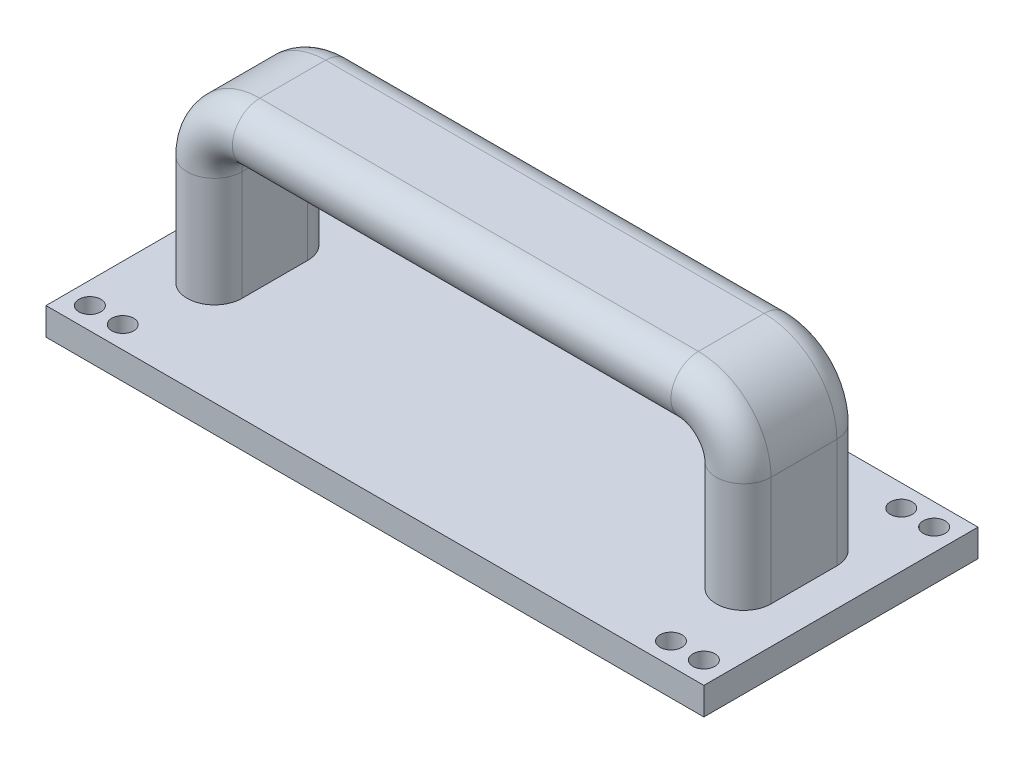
ISO-10303-21;
HEADER;
FILE_DESCRIPTION(('STEP AP214'),'2;1');
FILE_NAME('part.step','',(''),(''),'','','');
FILE_SCHEMA(('AUTOMOTIVE_DESIGN { 1 0 10303 214 1 1 1 1 }'));
ENDSEC;
DATA;
#1=APPLICATION_CONTEXT('core data for automotive mechanical design processes');
#2=APPLICATION_PROTOCOL_DEFINITION('international standard','automotive_design',2000,#1);
#3=PRODUCT_CONTEXT('',#1,'mechanical');
#4=PRODUCT('Part','Part','',(#3));
#5=PRODUCT_RELATED_PRODUCT_CATEGORY('part','',(#4));
#6=PRODUCT_DEFINITION_FORMATION('','',#4);
#7=PRODUCT_DEFINITION_CONTEXT('part definition',#1,'design');
#8=PRODUCT_DEFINITION('design','',#6,#7);
#9=PRODUCT_DEFINITION_SHAPE('','',#8);
#10=(LENGTH_UNIT() NAMED_UNIT(*) SI_UNIT(.MILLI.,.METRE.));
#11=(NAMED_UNIT(*) PLANE_ANGLE_UNIT() SI_UNIT($,.RADIAN.));
#12=(NAMED_UNIT(*) SI_UNIT($,.STERADIAN.) SOLID_ANGLE_UNIT());
#13=UNCERTAINTY_MEASURE_WITH_UNIT(LENGTH_MEASURE(1.E-05),#10,'distance_accuracy_value','');
#14=(GEOMETRIC_REPRESENTATION_CONTEXT(3) GLOBAL_UNCERTAINTY_ASSIGNED_CONTEXT((#13)) GLOBAL_UNIT_ASSIGNED_CONTEXT((#10,
#11,#12)) REPRESENTATION_CONTEXT('',''));
#15=CARTESIAN_POINT('',(0.,0.,0.));
#16=DIRECTION('',(0.,0.,1.));
#17=DIRECTION('',(1.,0.,0.));
#18=AXIS2_PLACEMENT_3D('',#15,#16,#17);
#19=CARTESIAN_POINT('',(0.,5.,0.));
#20=DIRECTION('',(0.,-1.,0.));
#21=DIRECTION('',(0.,0.,-1.));
#22=AXIS2_PLACEMENT_3D('',#19,#20,#21);
#23=PLANE('',#22);
#24=CARTESIAN_POINT('',(56.,5.,21.));
#25=DIRECTION('',(0.,1.,0.));
#26=DIRECTION('',(0.,0.,1.));
#27=AXIS2_PLACEMENT_3D('',#24,#25,#26);
#28=CIRCLE('',#27,2.);
#29=CARTESIAN_POINT('',(56.,5.,23.));
#30=VERTEX_POINT('',#29);
#31=EDGE_CURVE('E596',#30,#30,#28,.T.);
#32=ORIENTED_EDGE('',*,*,#31,.F.);
#33=EDGE_LOOP('',(#32));
#34=FACE_BOUND('',#33,.T.);
#35=CARTESIAN_POINT('',(-56.,5.,21.));
#36=DIRECTION('',(0.,1.,0.));
#37=DIRECTION('',(0.,0.,-1.));
#38=AXIS2_PLACEMENT_3D('',#35,#36,#37);
#39=CIRCLE('',#38,2.);
#40=CARTESIAN_POINT('',(-56.,5.,19.));
#41=VERTEX_POINT('',#40);
#42=EDGE_CURVE('E602',#41,#41,#39,.T.);
#43=ORIENTED_EDGE('',*,*,#42,.F.);
#44=EDGE_LOOP('',(#43));
#45=FACE_BOUND('',#44,.T.);
#46=CARTESIAN_POINT('',(-50.,5.,21.));
#47=DIRECTION('',(0.,1.,0.));
#48=DIRECTION('',(0.,0.,-1.));
#49=AXIS2_PLACEMENT_3D('',#46,#47,#48);
#50=CIRCLE('',#49,2.);
#51=CARTESIAN_POINT('',(-50.,5.,19.));
#52=VERTEX_POINT('',#51);
#53=EDGE_CURVE('E622',#52,#52,#50,.T.);
#54=ORIENTED_EDGE('',*,*,#53,.F.);
#55=EDGE_LOOP('',(#54));
#56=FACE_BOUND('',#55,.T.);
#57=CARTESIAN_POINT('',(-50.,5.,-21.));
#58=DIRECTION('',(0.,1.,0.));
#59=DIRECTION('',(0.,0.,1.));
#60=AXIS2_PLACEMENT_3D('',#57,#58,#59);
#61=CIRCLE('',#60,2.);
#62=CARTESIAN_POINT('',(-50.,5.,-19.));
#63=VERTEX_POINT('',#62);
#64=EDGE_CURVE('E614',#63,#63,#61,.T.);
#65=ORIENTED_EDGE('',*,*,#64,.F.);
#66=EDGE_LOOP('',(#65));
#67=FACE_BOUND('',#66,.T.);
#68=CARTESIAN_POINT('',(50.,5.,21.));
#69=DIRECTION('',(0.,1.,0.));
#70=DIRECTION('',(0.,0.,1.));
#71=AXIS2_PLACEMENT_3D('',#68,#69,#70);
#72=CIRCLE('',#71,2.);
#73=CARTESIAN_POINT('',(50.,5.,23.));
#74=VERTEX_POINT('',#73);
#75=EDGE_CURVE('E605',#74,#74,#72,.T.);
#76=ORIENTED_EDGE('',*,*,#75,.F.);
#77=EDGE_LOOP('',(#76));
#78=FACE_BOUND('',#77,.T.);
#79=CARTESIAN_POINT('',(50.,5.,-21.));
#80=DIRECTION('',(0.,1.,0.));
#81=DIRECTION('',(0.,0.,-1.));
#82=AXIS2_PLACEMENT_3D('',#79,#80,#81);
#83=CIRCLE('',#82,2.);
#84=CARTESIAN_POINT('',(50.,5.,-23.));
#85=VERTEX_POINT('',#84);
#86=EDGE_CURVE('E782',#85,#85,#83,.T.);
#87=ORIENTED_EDGE('',*,*,#86,.F.);
#88=EDGE_LOOP('',(#87));
#89=FACE_BOUND('',#88,.T.);
#90=CARTESIAN_POINT('',(56.,5.,-21.));
#91=DIRECTION('',(0.,1.,0.));
#92=DIRECTION('',(0.,0.,-1.));
#93=AXIS2_PLACEMENT_3D('',#90,#91,#92);
#94=CIRCLE('',#93,2.);
#95=CARTESIAN_POINT('',(56.,5.,-23.));
#96=VERTEX_POINT('',#95);
#97=EDGE_CURVE('E774',#96,#96,#94,.T.);
#98=ORIENTED_EDGE('',*,*,#97,.F.);
#99=EDGE_LOOP('',(#98));
#100=FACE_BOUND('',#99,.T.);
#101=CARTESIAN_POINT('',(-56.,5.,-21.));
#102=DIRECTION('',(0.,1.,0.));
#103=DIRECTION('',(0.,0.,1.));
#104=AXIS2_PLACEMENT_3D('',#101,#102,#103);
#105=CIRCLE('',#104,2.);
#106=CARTESIAN_POINT('',(-56.,5.,-19.));
#107=VERTEX_POINT('',#106);
#108=EDGE_CURVE('E613',#107,#107,#105,.T.);
#109=ORIENTED_EDGE('',*,*,#108,.F.);
#110=EDGE_LOOP('',(#109));
#111=FACE_BOUND('',#110,.T.);
#112=DIRECTION('',(0.,0.,-1.));
#113=VECTOR('',#112,1.);
#114=CARTESIAN_POINT('',(43.2576884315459,5.00000000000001,-6.));
#115=LINE('',#114,#113);
#116=CARTESIAN_POINT('',(43.2576884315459,5.00000000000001,6.));
#117=VERTEX_POINT('',#116);
#118=CARTESIAN_POINT('',(43.2576884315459,5.00000000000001,-6.));
#119=VERTEX_POINT('',#118);
#120=EDGE_CURVE('E151',#117,#119,#115,.T.);
#121=ORIENTED_EDGE('',*,*,#120,.T.);
#122=CARTESIAN_POINT('',(48.2576884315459,5.00000000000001,-6.));
#123=DIRECTION('',(0.,-1.,0.));
#124=DIRECTION('',(0.,0.,1.));
#125=AXIS2_PLACEMENT_3D('',#122,#123,#124);
#126=CIRCLE('',#125,5.);
#127=CARTESIAN_POINT('',(53.2576884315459,5.00000000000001,-6.));
#128=VERTEX_POINT('',#127);
#129=EDGE_CURVE('E159',#119,#128,#126,.T.);
#130=ORIENTED_EDGE('',*,*,#129,.T.);
#131=DIRECTION('',(0.,0.,1.));
#132=VECTOR('',#131,1.);
#133=CARTESIAN_POINT('',(53.2576884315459,5.00000000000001,-6.));
#134=LINE('',#133,#132);
#135=CARTESIAN_POINT('',(53.2576884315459,5.00000000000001,6.));
#136=VERTEX_POINT('',#135);
#137=EDGE_CURVE('E176',#128,#136,#134,.T.);
#138=ORIENTED_EDGE('',*,*,#137,.T.);
#139=CARTESIAN_POINT('',(48.2576884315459,5.00000000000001,6.));
#140=DIRECTION('',(0.,-1.,0.));
#141=DIRECTION('',(0.,0.,1.));
#142=AXIS2_PLACEMENT_3D('',#139,#140,#141);
#143=CIRCLE('',#142,5.);
#144=EDGE_CURVE('E166',#136,#117,#143,.T.);
#145=ORIENTED_EDGE('',*,*,#144,.T.);
#146=EDGE_LOOP('',(#121,#130,#138,#145));
#147=FACE_BOUND('',#146,.T.);
#148=DIRECTION('',(0.,0.,-1.));
#149=VECTOR('',#148,1.);
#150=CARTESIAN_POINT('',(60.,5.,25.));
#151=LINE('',#150,#149);
#152=CARTESIAN_POINT('',(60.,5.,25.));
#153=VERTEX_POINT('',#152);
#154=CARTESIAN_POINT('',(60.,5.,-25.));
#155=VERTEX_POINT('',#154);
#156=EDGE_CURVE('E212',#153,#155,#151,.T.);
#157=ORIENTED_EDGE('',*,*,#156,.T.);
#158=DIRECTION('',(-1.,0.,0.));
#159=VECTOR('',#158,1.);
#160=CARTESIAN_POINT('',(-60.,5.,-25.));
#161=LINE('',#160,#159);
#162=CARTESIAN_POINT('',(-60.,5.,-25.));
#163=VERTEX_POINT('',#162);
#164=EDGE_CURVE('E216',#155,#163,#161,.T.);
#165=ORIENTED_EDGE('',*,*,#164,.T.);
#166=DIRECTION('',(0.,0.,1.));
#167=VECTOR('',#166,1.);
#168=CARTESIAN_POINT('',(-60.,5.,25.));
#169=LINE('',#168,#167);
#170=CARTESIAN_POINT('',(-60.,5.,25.));
#171=VERTEX_POINT('',#170);
#172=EDGE_CURVE('E220',#163,#171,#169,.T.);
#173=ORIENTED_EDGE('',*,*,#172,.T.);
#174=DIRECTION('',(1.,0.,0.));
#175=VECTOR('',#174,1.);
#176=CARTESIAN_POINT('',(-60.,5.,25.));
#177=LINE('',#176,#175);
#178=EDGE_CURVE('E223',#171,#153,#177,.T.);
#179=ORIENTED_EDGE('',*,*,#178,.T.);
#180=EDGE_LOOP('',(#157,#165,#173,#179));
#181=FACE_BOUND('',#180,.T.);
#182=CARTESIAN_POINT('',(-48.2576884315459,5.,-6.));
#183=DIRECTION('',(0.,1.,0.));
#184=DIRECTION('',(0.,0.,1.));
#185=AXIS2_PLACEMENT_3D('',#182,#183,#184);
#186=CIRCLE('',#185,5.);
#187=CARTESIAN_POINT('',(-43.2576884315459,5.,-6.));
#188=VERTEX_POINT('',#187);
#189=CARTESIAN_POINT('',(-53.2576884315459,5.,-6.));
#190=VERTEX_POINT('',#189);
#191=EDGE_CURVE('E61',#188,#190,#186,.T.);
#192=ORIENTED_EDGE('',*,*,#191,.F.);
#193=DIRECTION('',(0.,0.,-1.));
#194=VECTOR('',#193,1.);
#195=CARTESIAN_POINT('',(-43.2576884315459,5.,-6.));
#196=LINE('',#195,#194);
#197=CARTESIAN_POINT('',(-43.2576884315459,5.,6.));
#198=VERTEX_POINT('',#197);
#199=EDGE_CURVE('E674',#198,#188,#196,.T.);
#200=ORIENTED_EDGE('',*,*,#199,.F.);
#201=CARTESIAN_POINT('',(-48.2576884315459,5.,6.));
#202=DIRECTION('',(0.,1.,0.));
#203=DIRECTION('',(0.,0.,1.));
#204=AXIS2_PLACEMENT_3D('',#201,#202,#203);
#205=CIRCLE('',#204,5.);
#206=CARTESIAN_POINT('',(-53.2576884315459,5.,6.));
#207=VERTEX_POINT('',#206);
#208=EDGE_CURVE('E207',#207,#198,#205,.T.);
#209=ORIENTED_EDGE('',*,*,#208,.F.);
#210=DIRECTION('',(0.,0.,1.));
#211=VECTOR('',#210,1.);
#212=CARTESIAN_POINT('',(-53.2576884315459,5.,-6.));
#213=LINE('',#212,#211);
#214=EDGE_CURVE('E723',#190,#207,#213,.T.);
#215=ORIENTED_EDGE('',*,*,#214,.F.);
#216=EDGE_LOOP('',(#192,#200,#209,#215));
#217=FACE_BOUND('',#216,.T.);
#218=ADVANCED_FACE('F37',(#34,#45,#56,#67,#78,#89,#100,#111,#147,#181,#217),#23,.F.);
#219=CARTESIAN_POINT('',(60.,5.,25.));
#220=DIRECTION('',(-1.,0.,0.));
#221=DIRECTION('',(0.,0.,1.));
#222=AXIS2_PLACEMENT_3D('',#219,#220,#221);
#223=PLANE('',#222);
#224=DIRECTION('',(0.,0.,-1.));
#225=VECTOR('',#224,1.);
#226=CARTESIAN_POINT('',(60.,0.,25.));
#227=LINE('',#226,#225);
#228=CARTESIAN_POINT('',(60.,0.,25.));
#229=VERTEX_POINT('',#228);
#230=CARTESIAN_POINT('',(60.,0.,-25.));
#231=VERTEX_POINT('',#230);
#232=EDGE_CURVE('E211',#229,#231,#227,.T.);
#233=ORIENTED_EDGE('',*,*,#232,.T.);
#234=DIRECTION('',(0.,-1.,0.));
#235=VECTOR('',#234,1.);
#236=CARTESIAN_POINT('',(60.,5.,-25.));
#237=LINE('',#236,#235);
#238=EDGE_CURVE('E11',#155,#231,#237,.T.);
#239=ORIENTED_EDGE('',*,*,#238,.F.);
#240=ORIENTED_EDGE('',*,*,#156,.F.);
#241=DIRECTION('',(0.,-1.,0.));
#242=VECTOR('',#241,1.);
#243=CARTESIAN_POINT('',(60.,5.,25.));
#244=LINE('',#243,#242);
#245=EDGE_CURVE('E226',#153,#229,#244,.T.);
#246=ORIENTED_EDGE('',*,*,#245,.T.);
#247=EDGE_LOOP('',(#233,#239,#240,#246));
#248=FACE_BOUND('',#247,.T.);
#249=ADVANCED_FACE('F39',(#248),#223,.F.);
#250=CARTESIAN_POINT('',(-60.,5.,-25.));
#251=DIRECTION('',(0.,0.,1.));
#252=DIRECTION('',(1.,0.,0.));
#253=AXIS2_PLACEMENT_3D('',#250,#251,#252);
#254=PLANE('',#253);
#255=DIRECTION('',(-1.,0.,0.));
#256=VECTOR('',#255,1.);
#257=CARTESIAN_POINT('',(-60.,0.,-25.));
#258=LINE('',#257,#256);
#259=CARTESIAN_POINT('',(-60.,0.,-25.));
#260=VERTEX_POINT('',#259);
#261=EDGE_CURVE('E230',#231,#260,#258,.T.);
#262=ORIENTED_EDGE('',*,*,#261,.T.);
#263=DIRECTION('',(0.,-1.,0.));
#264=VECTOR('',#263,1.);
#265=CARTESIAN_POINT('',(-60.,5.,-25.));
#266=LINE('',#265,#264);
#267=EDGE_CURVE('E46',#163,#260,#266,.T.);
#268=ORIENTED_EDGE('',*,*,#267,.F.);
#269=ORIENTED_EDGE('',*,*,#164,.F.);
#270=ORIENTED_EDGE('',*,*,#238,.T.);
#271=EDGE_LOOP('',(#262,#268,#269,#270));
#272=FACE_BOUND('',#271,.T.);
#273=ADVANCED_FACE('F264',(#272),#254,.F.);
#274=CARTESIAN_POINT('',(-60.,5.,25.));
#275=DIRECTION('',(1.,0.,0.));
#276=DIRECTION('',(0.,0.,-1.));
#277=AXIS2_PLACEMENT_3D('',#274,#275,#276);
#278=PLANE('',#277);
#279=DIRECTION('',(0.,0.,1.));
#280=VECTOR('',#279,1.);
#281=CARTESIAN_POINT('',(-60.,0.,25.));
#282=LINE('',#281,#280);
#283=CARTESIAN_POINT('',(-60.,0.,25.));
#284=VERTEX_POINT('',#283);
#285=EDGE_CURVE('E233',#260,#284,#282,.T.);
#286=ORIENTED_EDGE('',*,*,#285,.T.);
#287=DIRECTION('',(0.,-1.,0.));
#288=VECTOR('',#287,1.);
#289=CARTESIAN_POINT('',(-60.,5.,25.));
#290=LINE('',#289,#288);
#291=EDGE_CURVE('E241',#171,#284,#290,.T.);
#292=ORIENTED_EDGE('',*,*,#291,.F.);
#293=ORIENTED_EDGE('',*,*,#172,.F.);
#294=ORIENTED_EDGE('',*,*,#267,.T.);
#295=EDGE_LOOP('',(#286,#292,#293,#294));
#296=FACE_BOUND('',#295,.T.);
#297=ADVANCED_FACE('F250',(#296),#278,.F.);
#298=CARTESIAN_POINT('',(-60.,5.,25.));
#299=DIRECTION('',(0.,0.,-1.));
#300=DIRECTION('',(-1.,0.,0.));
#301=AXIS2_PLACEMENT_3D('',#298,#299,#300);
#302=PLANE('',#301);
#303=DIRECTION('',(1.,0.,0.));
#304=VECTOR('',#303,1.);
#305=CARTESIAN_POINT('',(-60.,0.,25.));
#306=LINE('',#305,#304);
#307=EDGE_CURVE('E217',#284,#229,#306,.T.);
#308=ORIENTED_EDGE('',*,*,#307,.T.);
#309=ORIENTED_EDGE('',*,*,#245,.F.);
#310=ORIENTED_EDGE('',*,*,#178,.F.);
#311=ORIENTED_EDGE('',*,*,#291,.T.);
#312=EDGE_LOOP('',(#308,#309,#310,#311));
#313=FACE_BOUND('',#312,.T.);
#314=ADVANCED_FACE('F259',(#313),#302,.F.);
#315=CARTESIAN_POINT('',(0.,0.,0.));
#316=DIRECTION('',(0.,-1.,0.));
#317=DIRECTION('',(0.,0.,-1.));
#318=AXIS2_PLACEMENT_3D('',#315,#316,#317);
#319=PLANE('',#318);
#320=CARTESIAN_POINT('',(56.,0.,21.));
#321=DIRECTION('',(0.,1.,0.));
#322=DIRECTION('',(0.,0.,1.));
#323=AXIS2_PLACEMENT_3D('',#320,#321,#322);
#324=CIRCLE('',#323,2.);
#325=CARTESIAN_POINT('',(56.,0.,23.));
#326=VERTEX_POINT('',#325);
#327=EDGE_CURVE('E594',#326,#326,#324,.T.);
#328=ORIENTED_EDGE('',*,*,#327,.T.);
#329=EDGE_LOOP('',(#328));
#330=FACE_BOUND('',#329,.T.);
#331=CARTESIAN_POINT('',(-56.,0.,21.));
#332=DIRECTION('',(0.,1.,0.));
#333=DIRECTION('',(0.,0.,-1.));
#334=AXIS2_PLACEMENT_3D('',#331,#332,#333);
#335=CIRCLE('',#334,2.);
#336=CARTESIAN_POINT('',(-56.,0.,19.));
#337=VERTEX_POINT('',#336);
#338=EDGE_CURVE('E626',#337,#337,#335,.T.);
#339=ORIENTED_EDGE('',*,*,#338,.T.);
#340=EDGE_LOOP('',(#339));
#341=FACE_BOUND('',#340,.T.);
#342=CARTESIAN_POINT('',(-50.,0.,21.));
#343=DIRECTION('',(0.,1.,0.));
#344=DIRECTION('',(0.,0.,-1.));
#345=AXIS2_PLACEMENT_3D('',#342,#343,#344);
#346=CIRCLE('',#345,2.);
#347=CARTESIAN_POINT('',(-50.,0.,19.));
#348=VERTEX_POINT('',#347);
#349=EDGE_CURVE('E618',#348,#348,#346,.T.);
#350=ORIENTED_EDGE('',*,*,#349,.T.);
#351=EDGE_LOOP('',(#350));
#352=FACE_BOUND('',#351,.T.);
#353=CARTESIAN_POINT('',(-50.,0.,-21.));
#354=DIRECTION('',(0.,1.,0.));
#355=DIRECTION('',(0.,0.,1.));
#356=AXIS2_PLACEMENT_3D('',#353,#354,#355);
#357=CIRCLE('',#356,2.);
#358=CARTESIAN_POINT('',(-50.,0.,-19.));
#359=VERTEX_POINT('',#358);
#360=EDGE_CURVE('E609',#359,#359,#357,.T.);
#361=ORIENTED_EDGE('',*,*,#360,.T.);
#362=EDGE_LOOP('',(#361));
#363=FACE_BOUND('',#362,.T.);
#364=CARTESIAN_POINT('',(50.,0.,21.));
#365=DIRECTION('',(0.,1.,0.));
#366=DIRECTION('',(0.,0.,1.));
#367=AXIS2_PLACEMENT_3D('',#364,#365,#366);
#368=CIRCLE('',#367,2.);
#369=CARTESIAN_POINT('',(50.,0.,23.));
#370=VERTEX_POINT('',#369);
#371=EDGE_CURVE('E598',#370,#370,#368,.T.);
#372=ORIENTED_EDGE('',*,*,#371,.T.);
#373=EDGE_LOOP('',(#372));
#374=FACE_BOUND('',#373,.T.);
#375=CARTESIAN_POINT('',(50.,0.,-21.));
#376=DIRECTION('',(0.,1.,0.));
#377=DIRECTION('',(0.,0.,-1.));
#378=AXIS2_PLACEMENT_3D('',#375,#376,#377);
#379=CIRCLE('',#378,2.);
#380=CARTESIAN_POINT('',(50.,0.,-23.));
#381=VERTEX_POINT('',#380);
#382=EDGE_CURVE('E786',#381,#381,#379,.T.);
#383=ORIENTED_EDGE('',*,*,#382,.T.);
#384=EDGE_LOOP('',(#383));
#385=FACE_BOUND('',#384,.T.);
#386=CARTESIAN_POINT('',(56.,0.,-21.));
#387=DIRECTION('',(0.,1.,0.));
#388=DIRECTION('',(0.,0.,-1.));
#389=AXIS2_PLACEMENT_3D('',#386,#387,#388);
#390=CIRCLE('',#389,2.);
#391=CARTESIAN_POINT('',(56.,0.,-23.));
#392=VERTEX_POINT('',#391);
#393=EDGE_CURVE('E778',#392,#392,#390,.T.);
#394=ORIENTED_EDGE('',*,*,#393,.T.);
#395=EDGE_LOOP('',(#394));
#396=FACE_BOUND('',#395,.T.);
#397=CARTESIAN_POINT('',(-56.,0.,-21.));
#398=DIRECTION('',(0.,1.,0.));
#399=DIRECTION('',(0.,0.,1.));
#400=AXIS2_PLACEMENT_3D('',#397,#398,#399);
#401=CIRCLE('',#400,2.);
#402=CARTESIAN_POINT('',(-56.,0.,-19.));
#403=VERTEX_POINT('',#402);
#404=EDGE_CURVE('E160',#403,#403,#401,.T.);
#405=ORIENTED_EDGE('',*,*,#404,.T.);
#406=EDGE_LOOP('',(#405));
#407=FACE_BOUND('',#406,.T.);
#408=ORIENTED_EDGE('',*,*,#232,.F.);
#409=ORIENTED_EDGE('',*,*,#307,.F.);
#410=ORIENTED_EDGE('',*,*,#285,.F.);
#411=ORIENTED_EDGE('',*,*,#261,.F.);
#412=EDGE_LOOP('',(#408,#409,#410,#411));
#413=FACE_BOUND('',#412,.T.);
#414=ADVANCED_FACE('F256',(#330,#341,#352,#363,#374,#385,#396,#407,#413),#319,.T.);
#415=CARTESIAN_POINT('',(43.2576884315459,5.00000000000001,-6.));
#416=DIRECTION('',(1.,0.,0.));
#417=DIRECTION('',(0.,0.,-1.));
#418=AXIS2_PLACEMENT_3D('',#415,#416,#417);
#419=PLANE('',#418);
#420=DIRECTION('',(0.,1.,0.));
#421=VECTOR('',#420,1.);
#422=CARTESIAN_POINT('',(43.2576884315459,5.00000000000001,-6.));
#423=LINE('',#422,#421);
#424=CARTESIAN_POINT('',(43.2576884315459,25.,-6.));
#425=VERTEX_POINT('',#424);
#426=EDGE_CURVE('E53',#119,#425,#423,.T.);
#427=ORIENTED_EDGE('',*,*,#426,.F.);
#428=ORIENTED_EDGE('',*,*,#120,.F.);
#429=DIRECTION('',(0.,1.,0.));
#430=VECTOR('',#429,1.);
#431=CARTESIAN_POINT('',(43.2576884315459,5.00000000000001,6.));
#432=LINE('',#431,#430);
#433=CARTESIAN_POINT('',(43.2576884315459,25.,6.));
#434=VERTEX_POINT('',#433);
#435=EDGE_CURVE('E154',#117,#434,#432,.T.);
#436=ORIENTED_EDGE('',*,*,#435,.T.);
#437=DIRECTION('',(0.,0.,-1.));
#438=VECTOR('',#437,1.);
#439=CARTESIAN_POINT('',(43.2576884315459,25.,-6.));
#440=LINE('',#439,#438);
#441=EDGE_CURVE('E172',#434,#425,#440,.T.);
#442=ORIENTED_EDGE('',*,*,#441,.T.);
#443=EDGE_LOOP('',(#427,#428,#436,#442));
#444=FACE_BOUND('',#443,.T.);
#445=ADVANCED_FACE('F153',(#444),#419,.F.);
#446=CARTESIAN_POINT('',(48.2576884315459,5.00000000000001,-6.));
#447=DIRECTION('',(0.,1.,0.));
#448=DIRECTION('',(0.,0.,1.));
#449=AXIS2_PLACEMENT_3D('',#446,#447,#448);
#450=CYLINDRICAL_SURFACE('',#449,5.);
#451=DIRECTION('',(0.,1.,0.));
#452=VECTOR('',#451,1.);
#453=CARTESIAN_POINT('',(53.2576884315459,5.00000000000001,-6.));
#454=LINE('',#453,#452);
#455=CARTESIAN_POINT('',(53.2576884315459,25.,-6.));
#456=VERTEX_POINT('',#455);
#457=EDGE_CURVE('E689',#128,#456,#454,.T.);
#458=ORIENTED_EDGE('',*,*,#457,.F.);
#459=ORIENTED_EDGE('',*,*,#129,.F.);
#460=ORIENTED_EDGE('',*,*,#426,.T.);
#461=CARTESIAN_POINT('',(48.2576884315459,25.,-6.));
#462=DIRECTION('',(0.,-1.,0.));
#463=DIRECTION('',(0.,0.,1.));
#464=AXIS2_PLACEMENT_3D('',#461,#462,#463);
#465=CIRCLE('',#464,5.);
#466=EDGE_CURVE('E636',#425,#456,#465,.T.);
#467=ORIENTED_EDGE('',*,*,#466,.T.);
#468=EDGE_LOOP('',(#458,#459,#460,#467));
#469=FACE_BOUND('',#468,.T.);
#470=ADVANCED_FACE('F301',(#469),#450,.T.);
#471=CARTESIAN_POINT('',(53.2576884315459,5.00000000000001,-6.));
#472=DIRECTION('',(-1.,0.,0.));
#473=DIRECTION('',(0.,0.,1.));
#474=AXIS2_PLACEMENT_3D('',#471,#472,#473);
#475=PLANE('',#474);
#476=DIRECTION('',(0.,1.,0.));
#477=VECTOR('',#476,1.);
#478=CARTESIAN_POINT('',(53.2576884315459,5.00000000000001,6.));
#479=LINE('',#478,#477);
#480=CARTESIAN_POINT('',(53.2576884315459,25.,6.));
#481=VERTEX_POINT('',#480);
#482=EDGE_CURVE('E188',#136,#481,#479,.T.);
#483=ORIENTED_EDGE('',*,*,#482,.F.);
#484=ORIENTED_EDGE('',*,*,#137,.F.);
#485=ORIENTED_EDGE('',*,*,#457,.T.);
#486=DIRECTION('',(0.,0.,1.));
#487=VECTOR('',#486,1.);
#488=CARTESIAN_POINT('',(53.2576884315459,25.,-6.));
#489=LINE('',#488,#487);
#490=EDGE_CURVE('E693',#456,#481,#489,.T.);
#491=ORIENTED_EDGE('',*,*,#490,.T.);
#492=EDGE_LOOP('',(#483,#484,#485,#491));
#493=FACE_BOUND('',#492,.T.);
#494=ADVANCED_FACE('F309',(#493),#475,.F.);
#495=CARTESIAN_POINT('',(48.2576884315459,5.00000000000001,6.));
#496=DIRECTION('',(0.,1.,0.));
#497=DIRECTION('',(0.,0.,1.));
#498=AXIS2_PLACEMENT_3D('',#495,#496,#497);
#499=CYLINDRICAL_SURFACE('',#498,5.);
#500=CARTESIAN_POINT('',(48.2576884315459,25.,6.));
#501=DIRECTION('',(0.,-1.,0.));
#502=DIRECTION('',(0.,0.,1.));
#503=AXIS2_PLACEMENT_3D('',#500,#501,#502);
#504=CIRCLE('',#503,5.);
#505=EDGE_CURVE('E169',#481,#434,#504,.T.);
#506=ORIENTED_EDGE('',*,*,#505,.T.);
#507=ORIENTED_EDGE('',*,*,#435,.F.);
#508=ORIENTED_EDGE('',*,*,#144,.F.);
#509=ORIENTED_EDGE('',*,*,#482,.T.);
#510=EDGE_LOOP('',(#506,#507,#508,#509));
#511=FACE_BOUND('',#510,.T.);
#512=ADVANCED_FACE('F164',(#511),#499,.T.);
#513=CARTESIAN_POINT('',(40.,25.,0.));
#514=DIRECTION('',(0.,0.,1.));
#515=DIRECTION('',(1.,0.,0.));
#516=AXIS2_PLACEMENT_3D('',#513,#514,#515);
#517=CYLINDRICAL_SURFACE('',#516,3.25768843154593);
#518=CARTESIAN_POINT('',(40.,25.,-6.));
#519=DIRECTION('',(0.,0.,1.));
#520=DIRECTION('',(1.,0.,0.));
#521=AXIS2_PLACEMENT_3D('',#518,#519,#520);
#522=CIRCLE('',#521,3.25768843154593);
#523=CARTESIAN_POINT('',(40.,28.2576884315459,-6.));
#524=VERTEX_POINT('',#523);
#525=EDGE_CURVE('E642',#425,#524,#522,.T.);
#526=ORIENTED_EDGE('',*,*,#525,.F.);
#527=ORIENTED_EDGE('',*,*,#441,.F.);
#528=CARTESIAN_POINT('',(40.,25.,6.));
#529=DIRECTION('',(0.,0.,1.));
#530=DIRECTION('',(1.,0.,0.));
#531=AXIS2_PLACEMENT_3D('',#528,#529,#530);
#532=CIRCLE('',#531,3.25768843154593);
#533=CARTESIAN_POINT('',(40.,28.2576884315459,6.));
#534=VERTEX_POINT('',#533);
#535=EDGE_CURVE('E187',#434,#534,#532,.T.);
#536=ORIENTED_EDGE('',*,*,#535,.T.);
#537=DIRECTION('',(0.,0.,-1.));
#538=VECTOR('',#537,1.);
#539=CARTESIAN_POINT('',(40.,28.2576884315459,-6.));
#540=LINE('',#539,#538);
#541=EDGE_CURVE('E638',#534,#524,#540,.T.);
#542=ORIENTED_EDGE('',*,*,#541,.T.);
#543=EDGE_LOOP('',(#526,#527,#536,#542));
#544=FACE_BOUND('',#543,.T.);
#545=ADVANCED_FACE('F324',(#544),#517,.F.);
#546=CARTESIAN_POINT('',(40.,25.,-6.));
#547=DIRECTION('',(0.,0.,1.));
#548=DIRECTION('',(1.,0.,0.));
#549=AXIS2_PLACEMENT_3D('',#546,#547,#548);
#550=TOROIDAL_SURFACE('',#549,8.25768843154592,5.);
#551=CARTESIAN_POINT('',(40.,25.,-6.));
#552=DIRECTION('',(0.,0.,1.));
#553=DIRECTION('',(1.,0.,0.));
#554=AXIS2_PLACEMENT_3D('',#551,#552,#553);
#555=CIRCLE('',#554,13.2576884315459);
#556=CARTESIAN_POINT('',(40.,38.2576884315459,-6.));
#557=VERTEX_POINT('',#556);
#558=EDGE_CURVE('E697',#456,#557,#555,.T.);
#559=ORIENTED_EDGE('',*,*,#558,.F.);
#560=ORIENTED_EDGE('',*,*,#466,.F.);
#561=ORIENTED_EDGE('',*,*,#525,.T.);
#562=CARTESIAN_POINT('',(40.,33.2576884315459,-6.));
#563=DIRECTION('',(1.,0.,0.));
#564=DIRECTION('',(0.,0.,1.));
#565=AXIS2_PLACEMENT_3D('',#562,#563,#564);
#566=CIRCLE('',#565,5.);
#567=EDGE_CURVE('E646',#524,#557,#566,.T.);
#568=ORIENTED_EDGE('',*,*,#567,.T.);
#569=EDGE_LOOP('',(#559,#560,#561,#568));
#570=FACE_BOUND('',#569,.T.);
#571=ADVANCED_FACE('F331',(#570),#550,.T.);
#572=CARTESIAN_POINT('',(40.,25.,0.));
#573=DIRECTION('',(0.,0.,1.));
#574=DIRECTION('',(1.,0.,0.));
#575=AXIS2_PLACEMENT_3D('',#572,#573,#574);
#576=CYLINDRICAL_SURFACE('',#575,13.2576884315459);
#577=CARTESIAN_POINT('',(40.,25.,6.));
#578=DIRECTION('',(0.,0.,1.));
#579=DIRECTION('',(1.,0.,0.));
#580=AXIS2_PLACEMENT_3D('',#577,#578,#579);
#581=CIRCLE('',#580,13.2576884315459);
#582=CARTESIAN_POINT('',(40.,38.2576884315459,6.));
#583=VERTEX_POINT('',#582);
#584=EDGE_CURVE('E194',#481,#583,#581,.T.);
#585=ORIENTED_EDGE('',*,*,#584,.F.);
#586=ORIENTED_EDGE('',*,*,#490,.F.);
#587=ORIENTED_EDGE('',*,*,#558,.T.);
#588=DIRECTION('',(0.,0.,1.));
#589=VECTOR('',#588,1.);
#590=CARTESIAN_POINT('',(40.,38.2576884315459,-6.));
#591=LINE('',#590,#589);
#592=EDGE_CURVE('E701',#557,#583,#591,.T.);
#593=ORIENTED_EDGE('',*,*,#592,.T.);
#594=EDGE_LOOP('',(#585,#586,#587,#593));
#595=FACE_BOUND('',#594,.T.);
#596=ADVANCED_FACE('F339',(#595),#576,.T.);
#597=CARTESIAN_POINT('',(40.,25.,6.));
#598=DIRECTION('',(0.,0.,1.));
#599=DIRECTION('',(1.,0.,0.));
#600=AXIS2_PLACEMENT_3D('',#597,#598,#599);
#601=TOROIDAL_SURFACE('',#600,8.25768843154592,5.);
#602=CARTESIAN_POINT('',(40.,33.2576884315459,6.));
#603=DIRECTION('',(1.,0.,0.));
#604=DIRECTION('',(0.,0.,1.));
#605=AXIS2_PLACEMENT_3D('',#602,#603,#604);
#606=CIRCLE('',#605,5.);
#607=EDGE_CURVE('E189',#583,#534,#606,.T.);
#608=ORIENTED_EDGE('',*,*,#607,.T.);
#609=ORIENTED_EDGE('',*,*,#535,.F.);
#610=ORIENTED_EDGE('',*,*,#505,.F.);
#611=ORIENTED_EDGE('',*,*,#584,.T.);
#612=EDGE_LOOP('',(#608,#609,#610,#611));
#613=FACE_BOUND('',#612,.T.);
#614=ADVANCED_FACE('F347',(#613),#601,.T.);
#615=CARTESIAN_POINT('',(40.,28.2576884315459,-6.));
#616=DIRECTION('',(0.,1.,0.));
#617=DIRECTION('',(-1.,0.,0.));
#618=AXIS2_PLACEMENT_3D('',#615,#616,#617);
#619=PLANE('',#618);
#620=DIRECTION('',(-1.,0.,0.));
#621=VECTOR('',#620,1.);
#622=CARTESIAN_POINT('',(40.,28.2576884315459,-6.));
#623=LINE('',#622,#621);
#624=CARTESIAN_POINT('',(-40.,28.2576884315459,-6.));
#625=VERTEX_POINT('',#624);
#626=EDGE_CURVE('E654',#524,#625,#623,.T.);
#627=ORIENTED_EDGE('',*,*,#626,.F.);
#628=ORIENTED_EDGE('',*,*,#541,.F.);
#629=DIRECTION('',(-1.,0.,0.));
#630=VECTOR('',#629,1.);
#631=CARTESIAN_POINT('',(40.,28.2576884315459,6.));
#632=LINE('',#631,#630);
#633=CARTESIAN_POINT('',(-40.,28.2576884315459,6.));
#634=VERTEX_POINT('',#633);
#635=EDGE_CURVE('E193',#534,#634,#632,.T.);
#636=ORIENTED_EDGE('',*,*,#635,.T.);
#637=DIRECTION('',(0.,0.,-1.));
#638=VECTOR('',#637,1.);
#639=CARTESIAN_POINT('',(-40.,28.2576884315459,-6.));
#640=LINE('',#639,#638);
#641=EDGE_CURVE('E650',#634,#625,#640,.T.);
#642=ORIENTED_EDGE('',*,*,#641,.T.);
#643=EDGE_LOOP('',(#627,#628,#636,#642));
#644=FACE_BOUND('',#643,.T.);
#645=ADVANCED_FACE('F355',(#644),#619,.F.);
#646=CARTESIAN_POINT('',(40.,33.2576884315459,-6.));
#647=DIRECTION('',(-1.,0.,0.));
#648=DIRECTION('',(0.,-1.,0.));
#649=AXIS2_PLACEMENT_3D('',#646,#647,#648);
#650=CYLINDRICAL_SURFACE('',#649,5.);
#651=DIRECTION('',(-1.,0.,0.));
#652=VECTOR('',#651,1.);
#653=CARTESIAN_POINT('',(40.,38.2576884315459,-6.));
#654=LINE('',#653,#652);
#655=CARTESIAN_POINT('',(-40.,38.2576884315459,-6.));
#656=VERTEX_POINT('',#655);
#657=EDGE_CURVE('E705',#557,#656,#654,.T.);
#658=ORIENTED_EDGE('',*,*,#657,.F.);
#659=ORIENTED_EDGE('',*,*,#567,.F.);
#660=ORIENTED_EDGE('',*,*,#626,.T.);
#661=CARTESIAN_POINT('',(-40.,33.2576884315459,-6.));
#662=DIRECTION('',(1.,0.,0.));
#663=DIRECTION('',(0.,0.,1.));
#664=AXIS2_PLACEMENT_3D('',#661,#662,#663);
#665=CIRCLE('',#664,5.);
#666=EDGE_CURVE('E658',#625,#656,#665,.T.);
#667=ORIENTED_EDGE('',*,*,#666,.T.);
#668=EDGE_LOOP('',(#658,#659,#660,#667));
#669=FACE_BOUND('',#668,.T.);
#670=ADVANCED_FACE('F363',(#669),#650,.T.);
#671=CARTESIAN_POINT('',(40.,38.2576884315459,-6.));
#672=DIRECTION('',(0.,-1.,0.));
#673=DIRECTION('',(1.,0.,0.));
#674=AXIS2_PLACEMENT_3D('',#671,#672,#673);
#675=PLANE('',#674);
#676=DIRECTION('',(-1.,0.,0.));
#677=VECTOR('',#676,1.);
#678=CARTESIAN_POINT('',(40.,38.2576884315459,6.));
#679=LINE('',#678,#677);
#680=CARTESIAN_POINT('',(-40.,38.2576884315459,6.));
#681=VERTEX_POINT('',#680);
#682=EDGE_CURVE('E200',#583,#681,#679,.T.);
#683=ORIENTED_EDGE('',*,*,#682,.F.);
#684=ORIENTED_EDGE('',*,*,#592,.F.);
#685=ORIENTED_EDGE('',*,*,#657,.T.);
#686=DIRECTION('',(0.,0.,1.));
#687=VECTOR('',#686,1.);
#688=CARTESIAN_POINT('',(-40.,38.2576884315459,-6.));
#689=LINE('',#688,#687);
#690=EDGE_CURVE('E709',#656,#681,#689,.T.);
#691=ORIENTED_EDGE('',*,*,#690,.T.);
#692=EDGE_LOOP('',(#683,#684,#685,#691));
#693=FACE_BOUND('',#692,.T.);
#694=ADVANCED_FACE('F371',(#693),#675,.F.);
#695=CARTESIAN_POINT('',(40.,33.2576884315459,6.));
#696=DIRECTION('',(-1.,0.,0.));
#697=DIRECTION('',(0.,-1.,0.));
#698=AXIS2_PLACEMENT_3D('',#695,#696,#697);
#699=CYLINDRICAL_SURFACE('',#698,5.);
#700=CARTESIAN_POINT('',(-40.,33.2576884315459,6.));
#701=DIRECTION('',(1.,0.,0.));
#702=DIRECTION('',(0.,0.,1.));
#703=AXIS2_PLACEMENT_3D('',#700,#701,#702);
#704=CIRCLE('',#703,5.);
#705=EDGE_CURVE('E195',#681,#634,#704,.T.);
#706=ORIENTED_EDGE('',*,*,#705,.T.);
#707=ORIENTED_EDGE('',*,*,#635,.F.);
#708=ORIENTED_EDGE('',*,*,#607,.F.);
#709=ORIENTED_EDGE('',*,*,#682,.T.);
#710=EDGE_LOOP('',(#706,#707,#708,#709));
#711=FACE_BOUND('',#710,.T.);
#712=ADVANCED_FACE('F379',(#711),#699,.T.);
#713=CARTESIAN_POINT('',(-40.,25.,0.));
#714=DIRECTION('',(0.,0.,1.));
#715=DIRECTION('',(1.,0.,0.));
#716=AXIS2_PLACEMENT_3D('',#713,#714,#715);
#717=CYLINDRICAL_SURFACE('',#716,3.25768843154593);
#718=CARTESIAN_POINT('',(-40.,25.,-6.));
#719=DIRECTION('',(0.,0.,1.));
#720=DIRECTION('',(0.,1.,0.));
#721=AXIS2_PLACEMENT_3D('',#718,#719,#720);
#722=CIRCLE('',#721,3.25768843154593);
#723=CARTESIAN_POINT('',(-43.2576884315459,25.,-6.));
#724=VERTEX_POINT('',#723);
#725=EDGE_CURVE('E666',#625,#724,#722,.T.);
#726=ORIENTED_EDGE('',*,*,#725,.F.);
#727=ORIENTED_EDGE('',*,*,#641,.F.);
#728=CARTESIAN_POINT('',(-40.,25.,6.));
#729=DIRECTION('',(0.,0.,1.));
#730=DIRECTION('',(0.,1.,0.));
#731=AXIS2_PLACEMENT_3D('',#728,#729,#730);
#732=CIRCLE('',#731,3.25768843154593);
#733=CARTESIAN_POINT('',(-43.2576884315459,25.,6.));
#734=VERTEX_POINT('',#733);
#735=EDGE_CURVE('E199',#634,#734,#732,.T.);
#736=ORIENTED_EDGE('',*,*,#735,.T.);
#737=DIRECTION('',(0.,0.,-1.));
#738=VECTOR('',#737,1.);
#739=CARTESIAN_POINT('',(-43.2576884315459,25.,-6.));
#740=LINE('',#739,#738);
#741=EDGE_CURVE('E662',#734,#724,#740,.T.);
#742=ORIENTED_EDGE('',*,*,#741,.T.);
#743=EDGE_LOOP('',(#726,#727,#736,#742));
#744=FACE_BOUND('',#743,.T.);
#745=ADVANCED_FACE('F387',(#744),#717,.F.);
#746=CARTESIAN_POINT('',(-40.,25.,-6.));
#747=DIRECTION('',(0.,0.,1.));
#748=DIRECTION('',(1.,0.,0.));
#749=AXIS2_PLACEMENT_3D('',#746,#747,#748);
#750=TOROIDAL_SURFACE('',#749,8.25768843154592,5.);
#751=CARTESIAN_POINT('',(-40.,25.,-6.));
#752=DIRECTION('',(0.,0.,1.));
#753=DIRECTION('',(0.,1.,0.));
#754=AXIS2_PLACEMENT_3D('',#751,#752,#753);
#755=CIRCLE('',#754,13.2576884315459);
#756=CARTESIAN_POINT('',(-53.2576884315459,25.,-6.));
#757=VERTEX_POINT('',#756);
#758=EDGE_CURVE('E713',#656,#757,#755,.T.);
#759=ORIENTED_EDGE('',*,*,#758,.F.);
#760=ORIENTED_EDGE('',*,*,#666,.F.);
#761=ORIENTED_EDGE('',*,*,#725,.T.);
#762=CARTESIAN_POINT('',(-48.2576884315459,25.,-6.));
#763=DIRECTION('',(0.,1.,0.));
#764=DIRECTION('',(0.,0.,1.));
#765=AXIS2_PLACEMENT_3D('',#762,#763,#764);
#766=CIRCLE('',#765,5.);
#767=EDGE_CURVE('E670',#724,#757,#766,.T.);
#768=ORIENTED_EDGE('',*,*,#767,.T.);
#769=EDGE_LOOP('',(#759,#760,#761,#768));
#770=FACE_BOUND('',#769,.T.);
#771=ADVANCED_FACE('F395',(#770),#750,.T.);
#772=CARTESIAN_POINT('',(-40.,25.,0.));
#773=DIRECTION('',(0.,0.,1.));
#774=DIRECTION('',(1.,0.,0.));
#775=AXIS2_PLACEMENT_3D('',#772,#773,#774);
#776=CYLINDRICAL_SURFACE('',#775,13.2576884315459);
#777=CARTESIAN_POINT('',(-40.,25.,6.));
#778=DIRECTION('',(0.,0.,1.));
#779=DIRECTION('',(0.,1.,0.));
#780=AXIS2_PLACEMENT_3D('',#777,#778,#779);
#781=CIRCLE('',#780,13.2576884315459);
#782=CARTESIAN_POINT('',(-53.2576884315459,25.,6.));
#783=VERTEX_POINT('',#782);
#784=EDGE_CURVE('E206',#681,#783,#781,.T.);
#785=ORIENTED_EDGE('',*,*,#784,.F.);
#786=ORIENTED_EDGE('',*,*,#690,.F.);
#787=ORIENTED_EDGE('',*,*,#758,.T.);
#788=DIRECTION('',(0.,0.,1.));
#789=VECTOR('',#788,1.);
#790=CARTESIAN_POINT('',(-53.2576884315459,25.,-6.));
#791=LINE('',#790,#789);
#792=EDGE_CURVE('E717',#757,#783,#791,.T.);
#793=ORIENTED_EDGE('',*,*,#792,.T.);
#794=EDGE_LOOP('',(#785,#786,#787,#793));
#795=FACE_BOUND('',#794,.T.);
#796=ADVANCED_FACE('F403',(#795),#776,.T.);
#797=CARTESIAN_POINT('',(-40.,25.,6.));
#798=DIRECTION('',(0.,0.,1.));
#799=DIRECTION('',(1.,0.,0.));
#800=AXIS2_PLACEMENT_3D('',#797,#798,#799);
#801=TOROIDAL_SURFACE('',#800,8.25768843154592,5.);
#802=CARTESIAN_POINT('',(-48.2576884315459,25.,6.));
#803=DIRECTION('',(0.,1.,0.));
#804=DIRECTION('',(0.,0.,1.));
#805=AXIS2_PLACEMENT_3D('',#802,#803,#804);
#806=CIRCLE('',#805,5.);
#807=EDGE_CURVE('E201',#783,#734,#806,.T.);
#808=ORIENTED_EDGE('',*,*,#807,.T.);
#809=ORIENTED_EDGE('',*,*,#735,.F.);
#810=ORIENTED_EDGE('',*,*,#705,.F.);
#811=ORIENTED_EDGE('',*,*,#784,.T.);
#812=EDGE_LOOP('',(#808,#809,#810,#811));
#813=FACE_BOUND('',#812,.T.);
#814=ADVANCED_FACE('F411',(#813),#801,.T.);
#815=CARTESIAN_POINT('',(-43.2576884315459,25.,-6.));
#816=DIRECTION('',(-1.,0.,0.));
#817=DIRECTION('',(0.,0.,1.));
#818=AXIS2_PLACEMENT_3D('',#815,#816,#817);
#819=PLANE('',#818);
#820=DIRECTION('',(0.,-1.,0.));
#821=VECTOR('',#820,1.);
#822=CARTESIAN_POINT('',(-43.2576884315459,25.,-6.));
#823=LINE('',#822,#821);
#824=EDGE_CURVE('E677',#724,#188,#823,.T.);
#825=ORIENTED_EDGE('',*,*,#824,.F.);
#826=ORIENTED_EDGE('',*,*,#741,.F.);
#827=DIRECTION('',(0.,-1.,0.));
#828=VECTOR('',#827,1.);
#829=CARTESIAN_POINT('',(-43.2576884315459,25.,6.));
#830=LINE('',#829,#828);
#831=EDGE_CURVE('E205',#734,#198,#830,.T.);
#832=ORIENTED_EDGE('',*,*,#831,.T.);
#833=ORIENTED_EDGE('',*,*,#199,.T.);
#834=EDGE_LOOP('',(#825,#826,#832,#833));
#835=FACE_BOUND('',#834,.T.);
#836=ADVANCED_FACE('F419',(#835),#819,.F.);
#837=CARTESIAN_POINT('',(-48.2576884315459,25.,-6.));
#838=DIRECTION('',(0.,-1.,0.));
#839=DIRECTION('',(0.,0.,-1.));
#840=AXIS2_PLACEMENT_3D('',#837,#838,#839);
#841=CYLINDRICAL_SURFACE('',#840,5.);
#842=DIRECTION('',(0.,-1.,0.));
#843=VECTOR('',#842,1.);
#844=CARTESIAN_POINT('',(-53.2576884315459,25.,-6.));
#845=LINE('',#844,#843);
#846=EDGE_CURVE('E720',#757,#190,#845,.T.);
#847=ORIENTED_EDGE('',*,*,#846,.F.);
#848=ORIENTED_EDGE('',*,*,#767,.F.);
#849=ORIENTED_EDGE('',*,*,#824,.T.);
#850=ORIENTED_EDGE('',*,*,#191,.T.);
#851=EDGE_LOOP('',(#847,#848,#849,#850));
#852=FACE_BOUND('',#851,.T.);
#853=ADVANCED_FACE('F426',(#852),#841,.T.);
#854=CARTESIAN_POINT('',(-53.2576884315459,25.,-6.));
#855=DIRECTION('',(1.,0.,0.));
#856=DIRECTION('',(0.,0.,-1.));
#857=AXIS2_PLACEMENT_3D('',#854,#855,#856);
#858=PLANE('',#857);
#859=DIRECTION('',(0.,-1.,0.));
#860=VECTOR('',#859,1.);
#861=CARTESIAN_POINT('',(-53.2576884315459,25.,6.));
#862=LINE('',#861,#860);
#863=EDGE_CURVE('E183',#783,#207,#862,.T.);
#864=ORIENTED_EDGE('',*,*,#863,.F.);
#865=ORIENTED_EDGE('',*,*,#792,.F.);
#866=ORIENTED_EDGE('',*,*,#846,.T.);
#867=ORIENTED_EDGE('',*,*,#214,.T.);
#868=EDGE_LOOP('',(#864,#865,#866,#867));
#869=FACE_BOUND('',#868,.T.);
#870=ADVANCED_FACE('F434',(#869),#858,.F.);
#871=CARTESIAN_POINT('',(-48.2576884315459,25.,6.));
#872=DIRECTION('',(0.,-1.,0.));
#873=DIRECTION('',(0.,0.,-1.));
#874=AXIS2_PLACEMENT_3D('',#871,#872,#873);
#875=CYLINDRICAL_SURFACE('',#874,5.);
#876=ORIENTED_EDGE('',*,*,#208,.T.);
#877=ORIENTED_EDGE('',*,*,#831,.F.);
#878=ORIENTED_EDGE('',*,*,#807,.F.);
#879=ORIENTED_EDGE('',*,*,#863,.T.);
#880=EDGE_LOOP('',(#876,#877,#878,#879));
#881=FACE_BOUND('',#880,.T.);
#882=ADVANCED_FACE('F280',(#881),#875,.T.);
#883=CARTESIAN_POINT('',(-56.,0.,-21.));
#884=DIRECTION('',(0.,1.,0.));
#885=DIRECTION('',(0.,0.,1.));
#886=AXIS2_PLACEMENT_3D('',#883,#884,#885);
#887=CYLINDRICAL_SURFACE('',#886,2.);
#888=ORIENTED_EDGE('',*,*,#404,.F.);
#889=EDGE_LOOP('',(#888));
#890=FACE_BOUND('',#889,.T.);
#891=ORIENTED_EDGE('',*,*,#108,.T.);
#892=EDGE_LOOP('',(#891));
#893=FACE_BOUND('',#892,.T.);
#894=ADVANCED_FACE('F303',(#890,#893),#887,.F.);
#895=CARTESIAN_POINT('',(56.,0.,-21.));
#896=DIRECTION('',(0.,1.,0.));
#897=DIRECTION('',(0.,0.,1.));
#898=AXIS2_PLACEMENT_3D('',#895,#896,#897);
#899=CYLINDRICAL_SURFACE('',#898,2.);
#900=ORIENTED_EDGE('',*,*,#393,.F.);
#901=EDGE_LOOP('',(#900));
#902=FACE_BOUND('',#901,.T.);
#903=ORIENTED_EDGE('',*,*,#97,.T.);
#904=EDGE_LOOP('',(#903));
#905=FACE_BOUND('',#904,.T.);
#906=ADVANCED_FACE('F454',(#902,#905),#899,.F.);
#907=CARTESIAN_POINT('',(50.,0.,-21.));
#908=DIRECTION('',(0.,1.,0.));
#909=DIRECTION('',(0.,0.,1.));
#910=AXIS2_PLACEMENT_3D('',#907,#908,#909);
#911=CYLINDRICAL_SURFACE('',#910,2.);
#912=ORIENTED_EDGE('',*,*,#382,.F.);
#913=EDGE_LOOP('',(#912));
#914=FACE_BOUND('',#913,.T.);
#915=ORIENTED_EDGE('',*,*,#86,.T.);
#916=EDGE_LOOP('',(#915));
#917=FACE_BOUND('',#916,.T.);
#918=ADVANCED_FACE('F462',(#914,#917),#911,.F.);
#919=CARTESIAN_POINT('',(50.,0.,21.));
#920=DIRECTION('',(0.,1.,0.));
#921=DIRECTION('',(0.,0.,1.));
#922=AXIS2_PLACEMENT_3D('',#919,#920,#921);
#923=CYLINDRICAL_SURFACE('',#922,2.);
#924=ORIENTED_EDGE('',*,*,#371,.F.);
#925=EDGE_LOOP('',(#924));
#926=FACE_BOUND('',#925,.T.);
#927=ORIENTED_EDGE('',*,*,#75,.T.);
#928=EDGE_LOOP('',(#927));
#929=FACE_BOUND('',#928,.T.);
#930=ADVANCED_FACE('F470',(#926,#929),#923,.F.);
#931=CARTESIAN_POINT('',(-50.,0.,-21.));
#932=DIRECTION('',(0.,1.,0.));
#933=DIRECTION('',(0.,0.,1.));
#934=AXIS2_PLACEMENT_3D('',#931,#932,#933);
#935=CYLINDRICAL_SURFACE('',#934,2.);
#936=ORIENTED_EDGE('',*,*,#360,.F.);
#937=EDGE_LOOP('',(#936));
#938=FACE_BOUND('',#937,.T.);
#939=ORIENTED_EDGE('',*,*,#64,.T.);
#940=EDGE_LOOP('',(#939));
#941=FACE_BOUND('',#940,.T.);
#942=ADVANCED_FACE('F478',(#938,#941),#935,.F.);
#943=CARTESIAN_POINT('',(-50.,0.,21.));
#944=DIRECTION('',(0.,1.,0.));
#945=DIRECTION('',(0.,0.,1.));
#946=AXIS2_PLACEMENT_3D('',#943,#944,#945);
#947=CYLINDRICAL_SURFACE('',#946,2.);
#948=ORIENTED_EDGE('',*,*,#349,.F.);
#949=EDGE_LOOP('',(#948));
#950=FACE_BOUND('',#949,.T.);
#951=ORIENTED_EDGE('',*,*,#53,.T.);
#952=EDGE_LOOP('',(#951));
#953=FACE_BOUND('',#952,.T.);
#954=ADVANCED_FACE('F486',(#950,#953),#947,.F.);
#955=CARTESIAN_POINT('',(-56.,0.,21.));
#956=DIRECTION('',(0.,1.,0.));
#957=DIRECTION('',(0.,0.,1.));
#958=AXIS2_PLACEMENT_3D('',#955,#956,#957);
#959=CYLINDRICAL_SURFACE('',#958,2.);
#960=ORIENTED_EDGE('',*,*,#338,.F.);
#961=EDGE_LOOP('',(#960));
#962=FACE_BOUND('',#961,.T.);
#963=ORIENTED_EDGE('',*,*,#42,.T.);
#964=EDGE_LOOP('',(#963));
#965=FACE_BOUND('',#964,.T.);
#966=ADVANCED_FACE('F494',(#962,#965),#959,.F.);
#967=CARTESIAN_POINT('',(56.,0.,21.));
#968=DIRECTION('',(0.,1.,0.));
#969=DIRECTION('',(0.,0.,1.));
#970=AXIS2_PLACEMENT_3D('',#967,#968,#969);
#971=CYLINDRICAL_SURFACE('',#970,2.);
#972=ORIENTED_EDGE('',*,*,#327,.F.);
#973=EDGE_LOOP('',(#972));
#974=FACE_BOUND('',#973,.T.);
#975=ORIENTED_EDGE('',*,*,#31,.T.);
#976=EDGE_LOOP('',(#975));
#977=FACE_BOUND('',#976,.T.);
#978=ADVANCED_FACE('F502',(#974,#977),#971,.F.);
#979=CLOSED_SHELL('',(#218,#249,#273,#297,#314,#414,#445,#470,#494,#512,#545,#571,#596,#614,
#645,#670,#694,#712,#745,#771,#796,#814,#836,#853,#870,#882,#894,#906,#918,#930,#942,#954,#966,#978));
#980=MANIFOLD_SOLID_BREP('B2',#979);
#981=ADVANCED_BREP_SHAPE_REPRESENTATION('',(#18,#980),#14);
#982=SHAPE_DEFINITION_REPRESENTATION(#9,#981);
ENDSEC;
END-ISO-10303-21;
